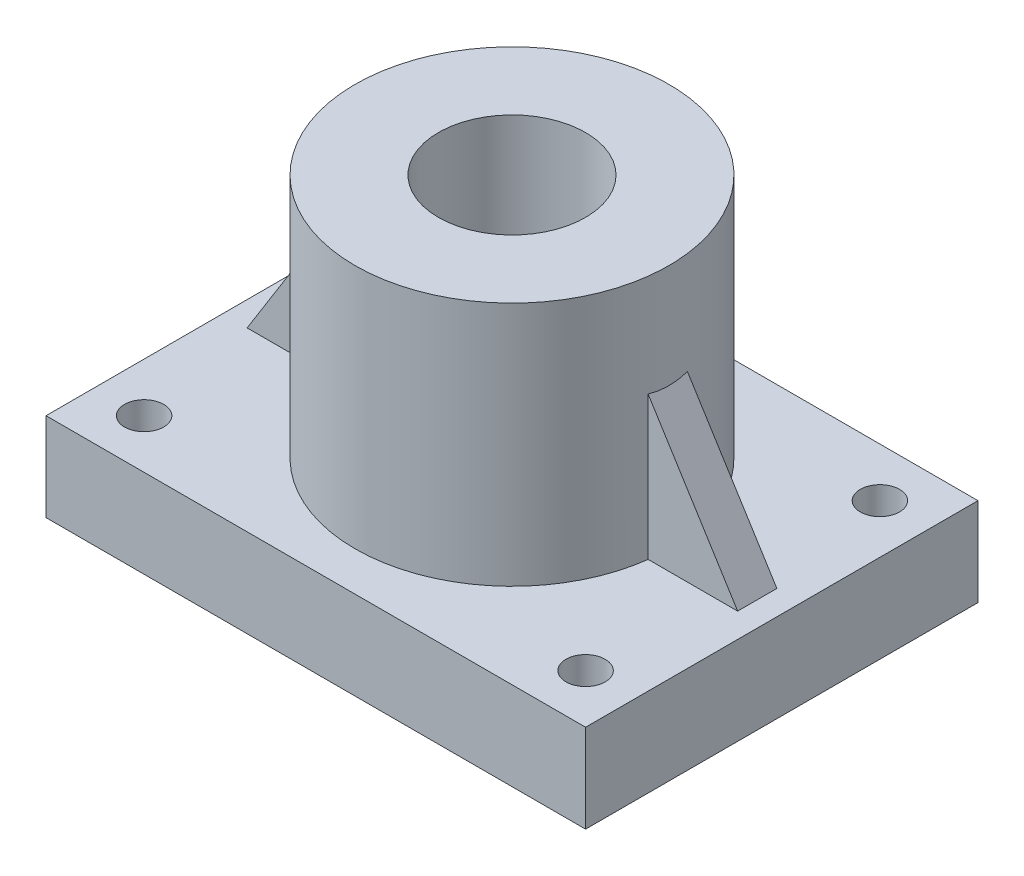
ISO-10303-21;
HEADER;
FILE_DESCRIPTION(('STEP AP214'),'2;1');
FILE_NAME('part.step','',(''),(''),'','','');
FILE_SCHEMA(('AUTOMOTIVE_DESIGN { 1 0 10303 214 1 1 1 1 }'));
ENDSEC;
DATA;
#1=APPLICATION_CONTEXT('core data for automotive mechanical design processes');
#2=APPLICATION_PROTOCOL_DEFINITION('international standard','automotive_design',2000,#1);
#3=PRODUCT_CONTEXT('',#1,'mechanical');
#4=PRODUCT('Part','Part','',(#3));
#5=PRODUCT_RELATED_PRODUCT_CATEGORY('part','',(#4));
#6=PRODUCT_DEFINITION_FORMATION('','',#4);
#7=PRODUCT_DEFINITION_CONTEXT('part definition',#1,'design');
#8=PRODUCT_DEFINITION('design','',#6,#7);
#9=PRODUCT_DEFINITION_SHAPE('','',#8);
#10=(LENGTH_UNIT() NAMED_UNIT(*) SI_UNIT(.MILLI.,.METRE.));
#11=(NAMED_UNIT(*) PLANE_ANGLE_UNIT() SI_UNIT($,.RADIAN.));
#12=(NAMED_UNIT(*) SI_UNIT($,.STERADIAN.) SOLID_ANGLE_UNIT());
#13=UNCERTAINTY_MEASURE_WITH_UNIT(LENGTH_MEASURE(1.E-05),#10,'distance_accuracy_value','');
#14=(GEOMETRIC_REPRESENTATION_CONTEXT(3) GLOBAL_UNCERTAINTY_ASSIGNED_CONTEXT((#13)) GLOBAL_UNIT_ASSIGNED_CONTEXT((#10,
#11,#12)) REPRESENTATION_CONTEXT('',''));
#15=CARTESIAN_POINT('',(0.,0.,0.));
#16=DIRECTION('',(0.,0.,1.));
#17=DIRECTION('',(1.,0.,0.));
#18=AXIS2_PLACEMENT_3D('',#15,#16,#17);
#19=CARTESIAN_POINT('',(0.,18.,0.));
#20=DIRECTION('',(0.,-1.,0.));
#21=DIRECTION('',(0.,0.,-1.));
#22=AXIS2_PLACEMENT_3D('',#19,#20,#21);
#23=PLANE('',#22);
#24=CARTESIAN_POINT('',(-45.,18.,30.));
#25=DIRECTION('',(0.,-1.,0.));
#26=DIRECTION('',(0.,0.,-1.));
#27=AXIS2_PLACEMENT_3D('',#24,#25,#26);
#28=CIRCLE('',#27,4.00000000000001);
#29=CARTESIAN_POINT('',(-45.,18.,26.));
#30=VERTEX_POINT('',#29);
#31=EDGE_CURVE('E234',#30,#30,#28,.F.);
#32=ORIENTED_EDGE('',*,*,#31,.F.);
#33=EDGE_LOOP('',(#32));
#34=FACE_BOUND('',#33,.T.);
#35=CARTESIAN_POINT('',(45.,18.,30.));
#36=DIRECTION('',(0.,-1.,0.));
#37=DIRECTION('',(0.,0.,-1.));
#38=AXIS2_PLACEMENT_3D('',#35,#36,#37);
#39=CIRCLE('',#38,4.00000000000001);
#40=CARTESIAN_POINT('',(45.,18.,26.));
#41=VERTEX_POINT('',#40);
#42=EDGE_CURVE('E226',#41,#41,#39,.F.);
#43=ORIENTED_EDGE('',*,*,#42,.F.);
#44=EDGE_LOOP('',(#43));
#45=FACE_BOUND('',#44,.T.);
#46=CARTESIAN_POINT('',(-45.,18.,-30.));
#47=DIRECTION('',(0.,-1.,0.));
#48=DIRECTION('',(0.,0.,-1.));
#49=AXIS2_PLACEMENT_3D('',#46,#47,#48);
#50=CIRCLE('',#49,4.00000000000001);
#51=CARTESIAN_POINT('',(-45.,18.,-34.));
#52=VERTEX_POINT('',#51);
#53=EDGE_CURVE('E225',#52,#52,#50,.F.);
#54=ORIENTED_EDGE('',*,*,#53,.F.);
#55=EDGE_LOOP('',(#54));
#56=FACE_BOUND('',#55,.T.);
#57=CARTESIAN_POINT('',(45.,18.,-30.));
#58=DIRECTION('',(0.,-1.,0.));
#59=DIRECTION('',(0.,0.,-1.));
#60=AXIS2_PLACEMENT_3D('',#57,#58,#59);
#61=CIRCLE('',#60,4.00000000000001);
#62=CARTESIAN_POINT('',(45.,18.,-34.));
#63=VERTEX_POINT('',#62);
#64=EDGE_CURVE('E128',#63,#63,#61,.F.);
#65=ORIENTED_EDGE('',*,*,#64,.F.);
#66=EDGE_LOOP('',(#65));
#67=FACE_BOUND('',#66,.T.);
#68=DIRECTION('',(0.,0.,-1.));
#69=VECTOR('',#68,1.);
#70=CARTESIAN_POINT('',(55.,18.,40.));
#71=LINE('',#70,#69);
#72=CARTESIAN_POINT('',(55.,18.,40.));
#73=VERTEX_POINT('',#72);
#74=CARTESIAN_POINT('',(55.,18.,-40.));
#75=VERTEX_POINT('',#74);
#76=EDGE_CURVE('E170',#73,#75,#71,.T.);
#77=ORIENTED_EDGE('',*,*,#76,.T.);
#78=DIRECTION('',(-1.,0.,0.));
#79=VECTOR('',#78,1.);
#80=CARTESIAN_POINT('',(-55.,18.,-40.));
#81=LINE('',#80,#79);
#82=CARTESIAN_POINT('',(-55.,18.,-40.));
#83=VERTEX_POINT('',#82);
#84=EDGE_CURVE('E168',#75,#83,#81,.T.);
#85=ORIENTED_EDGE('',*,*,#84,.T.);
#86=DIRECTION('',(0.,0.,1.));
#87=VECTOR('',#86,1.);
#88=CARTESIAN_POINT('',(-55.,18.,40.));
#89=LINE('',#88,#87);
#90=CARTESIAN_POINT('',(-55.,18.,40.));
#91=VERTEX_POINT('',#90);
#92=EDGE_CURVE('E171',#83,#91,#89,.T.);
#93=ORIENTED_EDGE('',*,*,#92,.T.);
#94=DIRECTION('',(1.,0.,0.));
#95=VECTOR('',#94,1.);
#96=CARTESIAN_POINT('',(-55.,18.,40.));
#97=LINE('',#96,#95);
#98=EDGE_CURVE('E174',#91,#73,#97,.T.);
#99=ORIENTED_EDGE('',*,*,#98,.T.);
#100=EDGE_LOOP('',(#77,#85,#93,#99));
#101=FACE_BOUND('',#100,.T.);
#102=DIRECTION('',(1.,0.,0.));
#103=VECTOR('',#102,1.);
#104=CARTESIAN_POINT('',(-25.,18.,4.));
#105=LINE('',#104,#103);
#106=CARTESIAN_POINT('',(-50.,18.,4.));
#107=VERTEX_POINT('',#106);
#108=CARTESIAN_POINT('',(-31.7490157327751,18.,4.));
#109=VERTEX_POINT('',#108);
#110=EDGE_CURVE('E63',#107,#109,#105,.T.);
#111=ORIENTED_EDGE('',*,*,#110,.F.);
#112=DIRECTION('',(0.,0.,1.));
#113=VECTOR('',#112,1.);
#114=CARTESIAN_POINT('',(-50.,18.,-4.));
#115=LINE('',#114,#113);
#116=CARTESIAN_POINT('',(-50.,18.,-4.));
#117=VERTEX_POINT('',#116);
#118=EDGE_CURVE('E57',#117,#107,#115,.T.);
#119=ORIENTED_EDGE('',*,*,#118,.F.);
#120=DIRECTION('',(1.,0.,0.));
#121=VECTOR('',#120,1.);
#122=CARTESIAN_POINT('',(-25.,18.,-4.));
#123=LINE('',#122,#121);
#124=CARTESIAN_POINT('',(-31.7490157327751,18.,-4.));
#125=VERTEX_POINT('',#124);
#126=EDGE_CURVE('E138',#117,#125,#123,.T.);
#127=ORIENTED_EDGE('',*,*,#126,.T.);
#128=CARTESIAN_POINT('',(0.,18.,0.));
#129=DIRECTION('',(0.,1.,0.));
#130=DIRECTION('',(0.,0.,1.));
#131=AXIS2_PLACEMENT_3D('',#128,#129,#130);
#132=CIRCLE('',#131,32.);
#133=CARTESIAN_POINT('',(31.7490157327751,18.,-4.));
#134=VERTEX_POINT('',#133);
#135=EDGE_CURVE('E162',#134,#125,#132,.T.);
#136=ORIENTED_EDGE('',*,*,#135,.F.);
#137=DIRECTION('',(1.,0.,0.));
#138=VECTOR('',#137,1.);
#139=CARTESIAN_POINT('',(25.,18.,-4.));
#140=LINE('',#139,#138);
#141=CARTESIAN_POINT('',(50.,18.,-4.));
#142=VERTEX_POINT('',#141);
#143=EDGE_CURVE('E141',#134,#142,#140,.T.);
#144=ORIENTED_EDGE('',*,*,#143,.T.);
#145=DIRECTION('',(0.,0.,1.));
#146=VECTOR('',#145,1.);
#147=CARTESIAN_POINT('',(50.,18.,-4.));
#148=LINE('',#147,#146);
#149=CARTESIAN_POINT('',(50.,18.,4.));
#150=VERTEX_POINT('',#149);
#151=EDGE_CURVE('E147',#142,#150,#148,.T.);
#152=ORIENTED_EDGE('',*,*,#151,.T.);
#153=DIRECTION('',(1.,0.,0.));
#154=VECTOR('',#153,1.);
#155=CARTESIAN_POINT('',(25.,18.,4.));
#156=LINE('',#155,#154);
#157=CARTESIAN_POINT('',(31.7490157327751,18.,4.));
#158=VERTEX_POINT('',#157);
#159=EDGE_CURVE('E142',#158,#150,#156,.T.);
#160=ORIENTED_EDGE('',*,*,#159,.F.);
#161=EDGE_CURVE('E167',#109,#158,#132,.T.);
#162=ORIENTED_EDGE('',*,*,#161,.F.);
#163=EDGE_LOOP('',(#111,#119,#127,#136,#144,#152,#160,#162));
#164=FACE_BOUND('',#163,.T.);
#165=ADVANCED_FACE('F41',(#34,#45,#56,#67,#101,#164),#23,.F.);
#166=CARTESIAN_POINT('',(0.,68.,0.));
#167=DIRECTION('',(0.,-1.,0.));
#168=DIRECTION('',(0.,0.,-1.));
#169=AXIS2_PLACEMENT_3D('',#166,#167,#168);
#170=CYLINDRICAL_SURFACE('',#169,32.);
#171=CARTESIAN_POINT('',(0.,68.,0.));
#172=DIRECTION('',(0.,1.,0.));
#173=DIRECTION('',(0.,0.,1.));
#174=AXIS2_PLACEMENT_3D('',#171,#172,#173);
#175=CIRCLE('',#174,32.);
#176=CARTESIAN_POINT('',(0.,68.,32.));
#177=VERTEX_POINT('',#176);
#178=EDGE_CURVE('E157',#177,#177,#175,.T.);
#179=ORIENTED_EDGE('',*,*,#178,.F.);
#180=EDGE_LOOP('',(#179));
#181=FACE_BOUND('',#180,.T.);
#182=ORIENTED_EDGE('',*,*,#135,.T.);
#183=DIRECTION('',(0.,-1.,0.));
#184=VECTOR('',#183,1.);
#185=CARTESIAN_POINT('',(-31.7490157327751,68.,-4.));
#186=LINE('',#185,#184);
#187=CARTESIAN_POINT('',(-31.7490157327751,47.2015748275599,-4.));
#188=VERTEX_POINT('',#187);
#189=EDGE_CURVE('E11',#125,#188,#186,.F.);
#190=ORIENTED_EDGE('',*,*,#189,.T.);
#191=CARTESIAN_POINT('',(0.,98.,0.));
#192=DIRECTION('',(-0.847998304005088,0.52999894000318,0.));
#193=DIRECTION('',(-0.52999894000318,-0.847998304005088,0.));
#194=AXIS2_PLACEMENT_3D('',#191,#192,#193);
#195=ELLIPSE('',#194,60.3774792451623,32.);
#196=CARTESIAN_POINT('',(-31.7490157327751,47.2015748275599,4.));
#197=VERTEX_POINT('',#196);
#198=EDGE_CURVE('E47',#188,#197,#195,.T.);
#199=ORIENTED_EDGE('',*,*,#198,.T.);
#200=DIRECTION('',(0.,-1.,0.));
#201=VECTOR('',#200,1.);
#202=CARTESIAN_POINT('',(-31.7490157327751,68.,4.));
#203=LINE('',#202,#201);
#204=EDGE_CURVE('E117',#109,#197,#203,.F.);
#205=ORIENTED_EDGE('',*,*,#204,.F.);
#206=ORIENTED_EDGE('',*,*,#161,.T.);
#207=DIRECTION('',(0.,-1.,0.));
#208=VECTOR('',#207,1.);
#209=CARTESIAN_POINT('',(31.7490157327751,68.,4.));
#210=LINE('',#209,#208);
#211=CARTESIAN_POINT('',(31.7490157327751,47.2015748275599,4.));
#212=VERTEX_POINT('',#211);
#213=EDGE_CURVE('E164',#158,#212,#210,.F.);
#214=ORIENTED_EDGE('',*,*,#213,.T.);
#215=CARTESIAN_POINT('',(0.,98.,0.));
#216=DIRECTION('',(0.847998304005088,0.52999894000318,0.));
#217=DIRECTION('',(0.52999894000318,-0.847998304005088,0.));
#218=AXIS2_PLACEMENT_3D('',#215,#216,#217);
#219=ELLIPSE('',#218,60.3774792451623,32.);
#220=CARTESIAN_POINT('',(31.7490157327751,47.2015748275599,-4.));
#221=VERTEX_POINT('',#220);
#222=EDGE_CURVE('E199',#212,#221,#219,.T.);
#223=ORIENTED_EDGE('',*,*,#222,.T.);
#224=DIRECTION('',(0.,-1.,0.));
#225=VECTOR('',#224,1.);
#226=CARTESIAN_POINT('',(31.7490157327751,68.,-4.));
#227=LINE('',#226,#225);
#228=EDGE_CURVE('E130',#134,#221,#227,.F.);
#229=ORIENTED_EDGE('',*,*,#228,.F.);
#230=EDGE_LOOP('',(#182,#190,#199,#205,#206,#214,#223,#229));
#231=FACE_BOUND('',#230,.T.);
#232=ADVANCED_FACE('F116',(#181,#231),#170,.T.);
#233=CARTESIAN_POINT('',(55.,18.,40.));
#234=DIRECTION('',(-1.,0.,0.));
#235=DIRECTION('',(0.,0.,1.));
#236=AXIS2_PLACEMENT_3D('',#233,#234,#235);
#237=PLANE('',#236);
#238=DIRECTION('',(0.,0.,-1.));
#239=VECTOR('',#238,1.);
#240=CARTESIAN_POINT('',(55.,0.,40.));
#241=LINE('',#240,#239);
#242=CARTESIAN_POINT('',(55.,0.,40.));
#243=VERTEX_POINT('',#242);
#244=CARTESIAN_POINT('',(55.,0.,-40.));
#245=VERTEX_POINT('',#244);
#246=EDGE_CURVE('E165',#243,#245,#241,.T.);
#247=ORIENTED_EDGE('',*,*,#246,.T.);
#248=DIRECTION('',(0.,-1.,0.));
#249=VECTOR('',#248,1.);
#250=CARTESIAN_POINT('',(55.,18.,-40.));
#251=LINE('',#250,#249);
#252=EDGE_CURVE('E193',#75,#245,#251,.T.);
#253=ORIENTED_EDGE('',*,*,#252,.F.);
#254=ORIENTED_EDGE('',*,*,#76,.F.);
#255=DIRECTION('',(0.,-1.,0.));
#256=VECTOR('',#255,1.);
#257=CARTESIAN_POINT('',(55.,18.,40.));
#258=LINE('',#257,#256);
#259=EDGE_CURVE('E180',#73,#243,#258,.T.);
#260=ORIENTED_EDGE('',*,*,#259,.T.);
#261=EDGE_LOOP('',(#247,#253,#254,#260));
#262=FACE_BOUND('',#261,.T.);
#263=ADVANCED_FACE('F43',(#262),#237,.F.);
#264=CARTESIAN_POINT('',(-55.,18.,-40.));
#265=DIRECTION('',(0.,0.,1.));
#266=DIRECTION('',(1.,0.,0.));
#267=AXIS2_PLACEMENT_3D('',#264,#265,#266);
#268=PLANE('',#267);
#269=DIRECTION('',(-1.,0.,0.));
#270=VECTOR('',#269,1.);
#271=CARTESIAN_POINT('',(-55.,0.,-40.));
#272=LINE('',#271,#270);
#273=CARTESIAN_POINT('',(-55.,0.,-40.));
#274=VERTEX_POINT('',#273);
#275=EDGE_CURVE('E176',#245,#274,#272,.T.);
#276=ORIENTED_EDGE('',*,*,#275,.T.);
#277=DIRECTION('',(0.,-1.,0.));
#278=VECTOR('',#277,1.);
#279=CARTESIAN_POINT('',(-55.,18.,-40.));
#280=LINE('',#279,#278);
#281=EDGE_CURVE('E189',#83,#274,#280,.T.);
#282=ORIENTED_EDGE('',*,*,#281,.F.);
#283=ORIENTED_EDGE('',*,*,#84,.F.);
#284=ORIENTED_EDGE('',*,*,#252,.T.);
#285=EDGE_LOOP('',(#276,#282,#283,#284));
#286=FACE_BOUND('',#285,.T.);
#287=ADVANCED_FACE('F268',(#286),#268,.F.);
#288=CARTESIAN_POINT('',(-55.,18.,40.));
#289=DIRECTION('',(1.,0.,0.));
#290=DIRECTION('',(0.,0.,-1.));
#291=AXIS2_PLACEMENT_3D('',#288,#289,#290);
#292=PLANE('',#291);
#293=DIRECTION('',(0.,0.,1.));
#294=VECTOR('',#293,1.);
#295=CARTESIAN_POINT('',(-55.,0.,40.));
#296=LINE('',#295,#294);
#297=CARTESIAN_POINT('',(-55.,0.,40.));
#298=VERTEX_POINT('',#297);
#299=EDGE_CURVE('E185',#274,#298,#296,.T.);
#300=ORIENTED_EDGE('',*,*,#299,.T.);
#301=DIRECTION('',(0.,-1.,0.));
#302=VECTOR('',#301,1.);
#303=CARTESIAN_POINT('',(-55.,18.,40.));
#304=LINE('',#303,#302);
#305=EDGE_CURVE('E190',#91,#298,#304,.T.);
#306=ORIENTED_EDGE('',*,*,#305,.F.);
#307=ORIENTED_EDGE('',*,*,#92,.F.);
#308=ORIENTED_EDGE('',*,*,#281,.T.);
#309=EDGE_LOOP('',(#300,#306,#307,#308));
#310=FACE_BOUND('',#309,.T.);
#311=ADVANCED_FACE('F272',(#310),#292,.F.);
#312=CARTESIAN_POINT('',(-55.,18.,40.));
#313=DIRECTION('',(0.,0.,-1.));
#314=DIRECTION('',(-1.,0.,0.));
#315=AXIS2_PLACEMENT_3D('',#312,#313,#314);
#316=PLANE('',#315);
#317=DIRECTION('',(1.,0.,0.));
#318=VECTOR('',#317,1.);
#319=CARTESIAN_POINT('',(-55.,0.,40.));
#320=LINE('',#319,#318);
#321=EDGE_CURVE('E173',#298,#243,#320,.T.);
#322=ORIENTED_EDGE('',*,*,#321,.T.);
#323=ORIENTED_EDGE('',*,*,#259,.F.);
#324=ORIENTED_EDGE('',*,*,#98,.F.);
#325=ORIENTED_EDGE('',*,*,#305,.T.);
#326=EDGE_LOOP('',(#322,#323,#324,#325));
#327=FACE_BOUND('',#326,.T.);
#328=ADVANCED_FACE('F277',(#327),#316,.F.);
#329=CARTESIAN_POINT('',(0.,0.,0.));
#330=DIRECTION('',(0.,-1.,0.));
#331=DIRECTION('',(0.,0.,-1.));
#332=AXIS2_PLACEMENT_3D('',#329,#330,#331);
#333=PLANE('',#332);
#334=CARTESIAN_POINT('',(-45.,0.,30.));
#335=DIRECTION('',(0.,1.,0.));
#336=DIRECTION('',(0.,0.,1.));
#337=AXIS2_PLACEMENT_3D('',#334,#335,#336);
#338=CIRCLE('',#337,4.00000000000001);
#339=CARTESIAN_POINT('',(-45.,0.,34.));
#340=VERTEX_POINT('',#339);
#341=EDGE_CURVE('E240',#340,#340,#338,.T.);
#342=ORIENTED_EDGE('',*,*,#341,.T.);
#343=EDGE_LOOP('',(#342));
#344=FACE_BOUND('',#343,.T.);
#345=CARTESIAN_POINT('',(45.,0.,30.));
#346=DIRECTION('',(0.,1.,0.));
#347=DIRECTION('',(0.,0.,1.));
#348=AXIS2_PLACEMENT_3D('',#345,#346,#347);
#349=CIRCLE('',#348,4.00000000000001);
#350=CARTESIAN_POINT('',(45.,0.,34.));
#351=VERTEX_POINT('',#350);
#352=EDGE_CURVE('E232',#351,#351,#349,.T.);
#353=ORIENTED_EDGE('',*,*,#352,.T.);
#354=EDGE_LOOP('',(#353));
#355=FACE_BOUND('',#354,.T.);
#356=CARTESIAN_POINT('',(-45.,0.,-30.));
#357=DIRECTION('',(0.,1.,0.));
#358=DIRECTION('',(0.,0.,1.));
#359=AXIS2_PLACEMENT_3D('',#356,#357,#358);
#360=CIRCLE('',#359,4.00000000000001);
#361=CARTESIAN_POINT('',(-45.,0.,-26.));
#362=VERTEX_POINT('',#361);
#363=EDGE_CURVE('E223',#362,#362,#360,.T.);
#364=ORIENTED_EDGE('',*,*,#363,.T.);
#365=EDGE_LOOP('',(#364));
#366=FACE_BOUND('',#365,.T.);
#367=CARTESIAN_POINT('',(45.,0.,-30.));
#368=DIRECTION('',(0.,1.,0.));
#369=DIRECTION('',(0.,0.,1.));
#370=AXIS2_PLACEMENT_3D('',#367,#368,#369);
#371=CIRCLE('',#370,4.00000000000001);
#372=CARTESIAN_POINT('',(45.,0.,-26.));
#373=VERTEX_POINT('',#372);
#374=EDGE_CURVE('E134',#373,#373,#371,.T.);
#375=ORIENTED_EDGE('',*,*,#374,.T.);
#376=EDGE_LOOP('',(#375));
#377=FACE_BOUND('',#376,.T.);
#378=CARTESIAN_POINT('',(0.,0.,0.));
#379=DIRECTION('',(0.,1.,0.));
#380=DIRECTION('',(0.,0.,1.));
#381=AXIS2_PLACEMENT_3D('',#378,#379,#380);
#382=CIRCLE('',#381,15.);
#383=CARTESIAN_POINT('',(0.,0.,15.));
#384=VERTEX_POINT('',#383);
#385=EDGE_CURVE('E154',#384,#384,#382,.T.);
#386=ORIENTED_EDGE('',*,*,#385,.T.);
#387=EDGE_LOOP('',(#386));
#388=FACE_BOUND('',#387,.T.);
#389=ORIENTED_EDGE('',*,*,#246,.F.);
#390=ORIENTED_EDGE('',*,*,#321,.F.);
#391=ORIENTED_EDGE('',*,*,#299,.F.);
#392=ORIENTED_EDGE('',*,*,#275,.F.);
#393=EDGE_LOOP('',(#389,#390,#391,#392));
#394=FACE_BOUND('',#393,.T.);
#395=ADVANCED_FACE('F243',(#344,#355,#366,#377,#388,#394),#333,.T.);
#396=CARTESIAN_POINT('',(0.,68.,0.));
#397=DIRECTION('',(0.,1.,0.));
#398=DIRECTION('',(0.,0.,1.));
#399=AXIS2_PLACEMENT_3D('',#396,#397,#398);
#400=PLANE('',#399);
#401=CARTESIAN_POINT('',(0.,68.,0.));
#402=DIRECTION('',(0.,1.,0.));
#403=DIRECTION('',(0.,0.,1.));
#404=AXIS2_PLACEMENT_3D('',#401,#402,#403);
#405=CIRCLE('',#404,15.);
#406=CARTESIAN_POINT('',(0.,68.,15.));
#407=VERTEX_POINT('',#406);
#408=EDGE_CURVE('E158',#407,#407,#405,.F.);
#409=ORIENTED_EDGE('',*,*,#408,.T.);
#410=EDGE_LOOP('',(#409));
#411=FACE_BOUND('',#410,.T.);
#412=ORIENTED_EDGE('',*,*,#178,.T.);
#413=EDGE_LOOP('',(#412));
#414=FACE_BOUND('',#413,.T.);
#415=ADVANCED_FACE('F276',(#411,#414),#400,.T.);
#416=CARTESIAN_POINT('',(0.,75.,0.));
#417=DIRECTION('',(0.,-1.,0.));
#418=DIRECTION('',(0.,0.,-1.));
#419=AXIS2_PLACEMENT_3D('',#416,#417,#418);
#420=CYLINDRICAL_SURFACE('',#419,15.);
#421=ORIENTED_EDGE('',*,*,#408,.F.);
#422=EDGE_LOOP('',(#421));
#423=FACE_BOUND('',#422,.T.);
#424=ORIENTED_EDGE('',*,*,#385,.F.);
#425=EDGE_LOOP('',(#424));
#426=FACE_BOUND('',#425,.T.);
#427=ADVANCED_FACE('F282',(#423,#426),#420,.F.);
#428=CARTESIAN_POINT('',(0.,0.,-4.));
#429=DIRECTION('',(0.,0.,1.));
#430=DIRECTION('',(1.,0.,0.));
#431=AXIS2_PLACEMENT_3D('',#428,#429,#430);
#432=PLANE('',#431);
#433=ORIENTED_EDGE('',*,*,#143,.F.);
#434=ORIENTED_EDGE('',*,*,#228,.T.);
#435=DIRECTION('',(-0.52999894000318,0.847998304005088,0.));
#436=VECTOR('',#435,1.);
#437=CARTESIAN_POINT('',(50.,18.,-4.));
#438=LINE('',#437,#436);
#439=EDGE_CURVE('E148',#142,#221,#438,.T.);
#440=ORIENTED_EDGE('',*,*,#439,.F.);
#441=EDGE_LOOP('',(#433,#434,#440));
#442=FACE_BOUND('',#441,.T.);
#443=ADVANCED_FACE('F206',(#442),#432,.F.);
#444=CARTESIAN_POINT('',(0.,0.,4.));
#445=DIRECTION('',(0.,0.,1.));
#446=DIRECTION('',(1.,0.,0.));
#447=AXIS2_PLACEMENT_3D('',#444,#445,#446);
#448=PLANE('',#447);
#449=ORIENTED_EDGE('',*,*,#213,.F.);
#450=ORIENTED_EDGE('',*,*,#159,.T.);
#451=DIRECTION('',(-0.52999894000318,0.847998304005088,0.));
#452=VECTOR('',#451,1.);
#453=CARTESIAN_POINT('',(50.,18.,4.));
#454=LINE('',#453,#452);
#455=EDGE_CURVE('E150',#150,#212,#454,.T.);
#456=ORIENTED_EDGE('',*,*,#455,.T.);
#457=EDGE_LOOP('',(#449,#450,#456));
#458=FACE_BOUND('',#457,.T.);
#459=ADVANCED_FACE('F214',(#458),#448,.T.);
#460=CARTESIAN_POINT('',(50.,18.,-4.));
#461=DIRECTION('',(0.847998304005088,0.52999894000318,0.));
#462=DIRECTION('',(-0.52999894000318,0.847998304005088,0.));
#463=AXIS2_PLACEMENT_3D('',#460,#461,#462);
#464=PLANE('',#463);
#465=ORIENTED_EDGE('',*,*,#222,.F.);
#466=ORIENTED_EDGE('',*,*,#455,.F.);
#467=ORIENTED_EDGE('',*,*,#151,.F.);
#468=ORIENTED_EDGE('',*,*,#439,.T.);
#469=EDGE_LOOP('',(#465,#466,#467,#468));
#470=FACE_BOUND('',#469,.T.);
#471=ADVANCED_FACE('F209',(#470),#464,.T.);
#472=CARTESIAN_POINT('',(0.,0.,-4.));
#473=DIRECTION('',(0.,0.,-1.));
#474=DIRECTION('',(-1.,0.,0.));
#475=AXIS2_PLACEMENT_3D('',#472,#473,#474);
#476=PLANE('',#475);
#477=ORIENTED_EDGE('',*,*,#189,.F.);
#478=ORIENTED_EDGE('',*,*,#126,.F.);
#479=DIRECTION('',(-0.52999894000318,-0.847998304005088,0.));
#480=VECTOR('',#479,1.);
#481=CARTESIAN_POINT('',(-50.,18.,-4.));
#482=LINE('',#481,#480);
#483=EDGE_CURVE('E135',#188,#117,#482,.T.);
#484=ORIENTED_EDGE('',*,*,#483,.F.);
#485=EDGE_LOOP('',(#477,#478,#484));
#486=FACE_BOUND('',#485,.T.);
#487=ADVANCED_FACE('F217',(#486),#476,.T.);
#488=CARTESIAN_POINT('',(0.,0.,4.));
#489=DIRECTION('',(0.,0.,-1.));
#490=DIRECTION('',(-1.,0.,0.));
#491=AXIS2_PLACEMENT_3D('',#488,#489,#490);
#492=PLANE('',#491);
#493=ORIENTED_EDGE('',*,*,#110,.T.);
#494=ORIENTED_EDGE('',*,*,#204,.T.);
#495=DIRECTION('',(-0.52999894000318,-0.847998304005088,0.));
#496=VECTOR('',#495,1.);
#497=CARTESIAN_POINT('',(-50.,18.,4.));
#498=LINE('',#497,#496);
#499=EDGE_CURVE('E127',#197,#107,#498,.T.);
#500=ORIENTED_EDGE('',*,*,#499,.T.);
#501=EDGE_LOOP('',(#493,#494,#500));
#502=FACE_BOUND('',#501,.T.);
#503=ADVANCED_FACE('F121',(#502),#492,.F.);
#504=CARTESIAN_POINT('',(-50.,18.,-4.));
#505=DIRECTION('',(-0.847998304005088,0.52999894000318,0.));
#506=DIRECTION('',(-0.52999894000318,-0.847998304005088,0.));
#507=AXIS2_PLACEMENT_3D('',#504,#505,#506);
#508=PLANE('',#507);
#509=ORIENTED_EDGE('',*,*,#198,.F.);
#510=ORIENTED_EDGE('',*,*,#483,.T.);
#511=ORIENTED_EDGE('',*,*,#118,.T.);
#512=ORIENTED_EDGE('',*,*,#499,.F.);
#513=EDGE_LOOP('',(#509,#510,#511,#512));
#514=FACE_BOUND('',#513,.T.);
#515=ADVANCED_FACE('F129',(#514),#508,.T.);
#516=CARTESIAN_POINT('',(45.,25.,-30.));
#517=DIRECTION('',(0.,-1.,0.));
#518=DIRECTION('',(0.,0.,-1.));
#519=AXIS2_PLACEMENT_3D('',#516,#517,#518);
#520=CYLINDRICAL_SURFACE('',#519,4.00000000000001);
#521=ORIENTED_EDGE('',*,*,#374,.F.);
#522=EDGE_LOOP('',(#521));
#523=FACE_BOUND('',#522,.T.);
#524=ORIENTED_EDGE('',*,*,#64,.T.);
#525=EDGE_LOOP('',(#524));
#526=FACE_BOUND('',#525,.T.);
#527=ADVANCED_FACE('F316',(#523,#526),#520,.F.);
#528=CARTESIAN_POINT('',(-45.,25.,-30.));
#529=DIRECTION('',(0.,-1.,0.));
#530=DIRECTION('',(0.,0.,-1.));
#531=AXIS2_PLACEMENT_3D('',#528,#529,#530);
#532=CYLINDRICAL_SURFACE('',#531,4.00000000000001);
#533=ORIENTED_EDGE('',*,*,#363,.F.);
#534=EDGE_LOOP('',(#533));
#535=FACE_BOUND('',#534,.T.);
#536=ORIENTED_EDGE('',*,*,#53,.T.);
#537=EDGE_LOOP('',(#536));
#538=FACE_BOUND('',#537,.T.);
#539=ADVANCED_FACE('F325',(#535,#538),#532,.F.);
#540=CARTESIAN_POINT('',(45.,25.,30.));
#541=DIRECTION('',(0.,-1.,0.));
#542=DIRECTION('',(0.,0.,-1.));
#543=AXIS2_PLACEMENT_3D('',#540,#541,#542);
#544=CYLINDRICAL_SURFACE('',#543,4.00000000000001);
#545=ORIENTED_EDGE('',*,*,#352,.F.);
#546=EDGE_LOOP('',(#545));
#547=FACE_BOUND('',#546,.T.);
#548=ORIENTED_EDGE('',*,*,#42,.T.);
#549=EDGE_LOOP('',(#548));
#550=FACE_BOUND('',#549,.T.);
#551=ADVANCED_FACE('F250',(#547,#550),#544,.F.);
#552=CARTESIAN_POINT('',(-45.,25.,30.));
#553=DIRECTION('',(0.,-1.,0.));
#554=DIRECTION('',(0.,0.,-1.));
#555=AXIS2_PLACEMENT_3D('',#552,#553,#554);
#556=CYLINDRICAL_SURFACE('',#555,4.00000000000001);
#557=ORIENTED_EDGE('',*,*,#341,.F.);
#558=EDGE_LOOP('',(#557));
#559=FACE_BOUND('',#558,.T.);
#560=ORIENTED_EDGE('',*,*,#31,.T.);
#561=EDGE_LOOP('',(#560));
#562=FACE_BOUND('',#561,.T.);
#563=ADVANCED_FACE('F242',(#559,#562),#556,.F.);
#564=CLOSED_SHELL('',(#165,#232,#263,#287,#311,#328,#395,#415,#427,#443,#459,#471,#487,#503,
#515,#527,#539,#551,#563));
#565=MANIFOLD_SOLID_BREP('B2',#564);
#566=ADVANCED_BREP_SHAPE_REPRESENTATION('',(#18,#565),#14);
#567=SHAPE_DEFINITION_REPRESENTATION(#9,#566);
ENDSEC;
END-ISO-10303-21;
